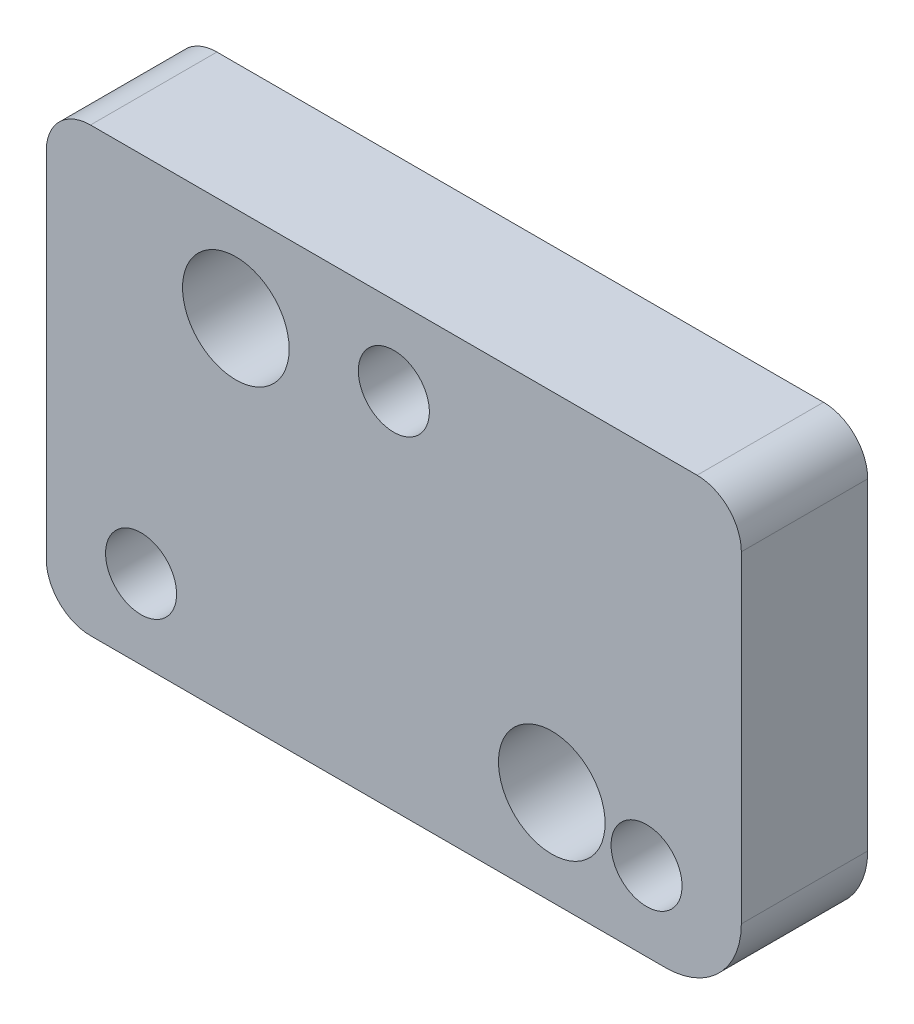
from build123d import *

# Parameters (mm, degrees)
BOSS_EXTRUDE1_DEPTH = 12.7
HOLE12_D            = 7.1374
HOLE13_D            = 7.1374
HOLE13_CBORE_D      = 10.7188
HOLE13_CBORE_DEPTH  = 7.874


with BuildPart() as part:
    # Sketch1 → Boss-Extrude1 (new body)
    with BuildSketch(Plane(origin=(0, 0, 71.9582), x_dir=(-1, 0, 0), z_dir=(0, 0, -1))):
        with BuildLine():
            Line((840.263295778, -53.175406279), (898.048295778, -53.175406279))
            ThreePointArc((898.048295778, -53.175406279), (901.191385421, -51.873495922), (902.493295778, -48.730406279))
            Line((902.493295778, -48.730406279), (902.493295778, -13.170406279))
            ThreePointArc((902.493295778, -13.170406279), (901.191385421, -10.027316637), (898.048295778, -8.725406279))
            Line((898.048295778, -8.725406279), (837.088295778, -8.725406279))
            ThreePointArc((837.088295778, -8.725406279), (833.945206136, -10.027316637), (832.643295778, -13.170406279))
            Line((832.643295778, -13.170406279), (832.643295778, -45.555406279))
            ThreePointArc((832.643295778, -45.555406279), (834.875142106, -50.943559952), (840.263295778, -53.175406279))
        make_face()
    extrude(amount=-BOSS_EXTRUDE1_DEPTH)

    # Hole12 (through all)
    with Locations(Plane(origin=(-838.514035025, -34.636765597, 71.9582), x_dir=(-1, 0, 0), z_dir=(0, 0, -1))):
        with Locations((3.654260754, -10.601140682), (54.454260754, -10.601140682), (29.054260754, 17.973859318)):
            Hole(HOLE12_D / 2)

    # Hole13 (through all)
    with Locations(Plane(origin=(-864.562402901, -42.715406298, 84.6582), x_dir=(1, 0, 0), z_dir=(0, 0, 1))):
        with Locations((12.869107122, -0.934999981), (-18.880892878, 24.465000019)):
            CounterBoreHole(HOLE13_D / 2, HOLE13_CBORE_D / 2, HOLE13_CBORE_DEPTH)


solid = part.part
